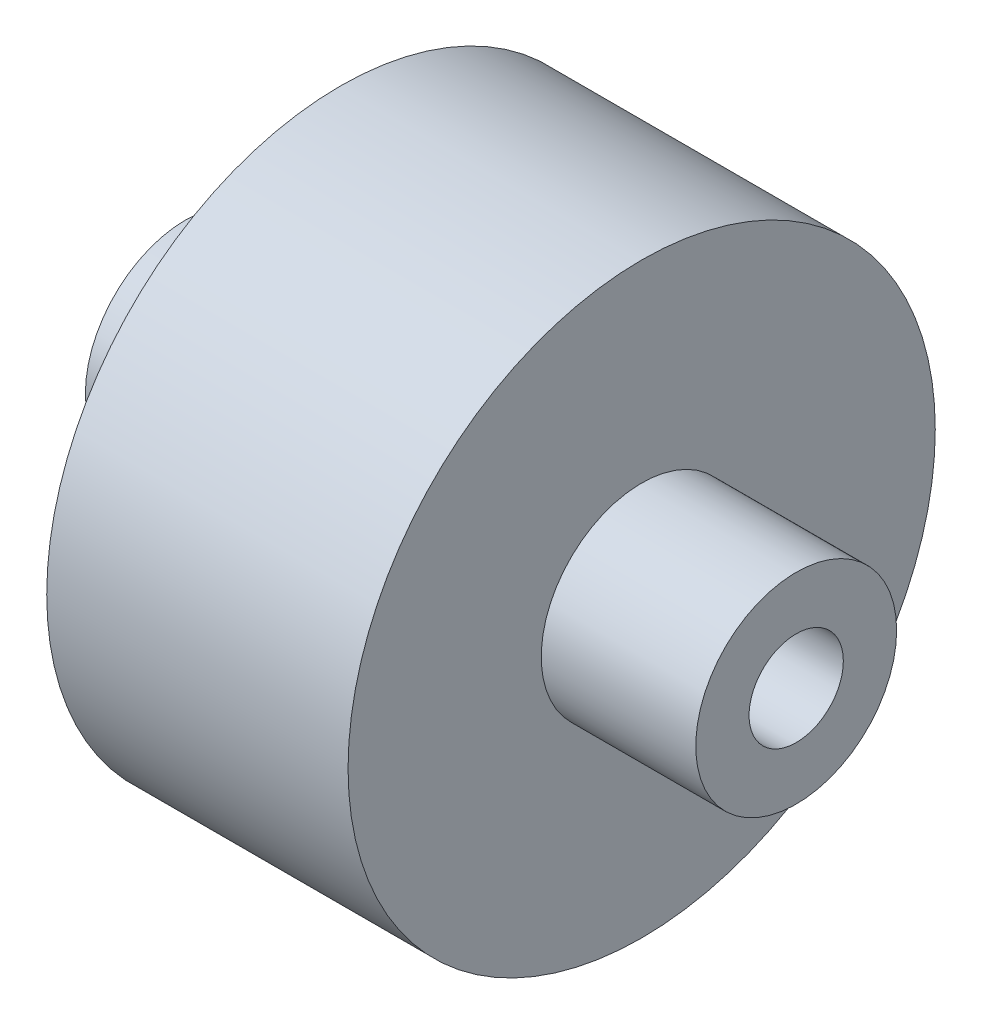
ISO-10303-21;
HEADER;
FILE_DESCRIPTION(('STEP AP214'),'2;1');
FILE_NAME('part.step','',(''),(''),'','','');
FILE_SCHEMA(('AUTOMOTIVE_DESIGN { 1 0 10303 214 1 1 1 1 }'));
ENDSEC;
DATA;
#1=APPLICATION_CONTEXT('core data for automotive mechanical design processes');
#2=APPLICATION_PROTOCOL_DEFINITION('international standard','automotive_design',2000,#1);
#3=PRODUCT_CONTEXT('',#1,'mechanical');
#4=PRODUCT('Part','Part','',(#3));
#5=PRODUCT_RELATED_PRODUCT_CATEGORY('part','',(#4));
#6=PRODUCT_DEFINITION_FORMATION('','',#4);
#7=PRODUCT_DEFINITION_CONTEXT('part definition',#1,'design');
#8=PRODUCT_DEFINITION('design','',#6,#7);
#9=PRODUCT_DEFINITION_SHAPE('','',#8);
#10=(LENGTH_UNIT() NAMED_UNIT(*) SI_UNIT(.MILLI.,.METRE.));
#11=(NAMED_UNIT(*) PLANE_ANGLE_UNIT() SI_UNIT($,.RADIAN.));
#12=(NAMED_UNIT(*) SI_UNIT($,.STERADIAN.) SOLID_ANGLE_UNIT());
#13=UNCERTAINTY_MEASURE_WITH_UNIT(LENGTH_MEASURE(1.E-05),#10,'distance_accuracy_value','');
#14=(GEOMETRIC_REPRESENTATION_CONTEXT(3) GLOBAL_UNCERTAINTY_ASSIGNED_CONTEXT((#13)) GLOBAL_UNIT_ASSIGNED_CONTEXT((#10,
#11,#12)) REPRESENTATION_CONTEXT('',''));
#15=CARTESIAN_POINT('',(0.,0.,0.));
#16=DIRECTION('',(0.,0.,1.));
#17=DIRECTION('',(1.,0.,0.));
#18=AXIS2_PLACEMENT_3D('',#15,#16,#17);
#19=CARTESIAN_POINT('',(19.5,0.,0.));
#20=DIRECTION('',(-1.,0.,0.));
#21=DIRECTION('',(0.,0.,1.));
#22=AXIS2_PLACEMENT_3D('',#19,#20,#21);
#23=CYLINDRICAL_SURFACE('',#22,19.);
#24=CARTESIAN_POINT('',(19.5,0.,0.));
#25=DIRECTION('',(1.,0.,0.));
#26=DIRECTION('',(0.,0.,-1.));
#27=AXIS2_PLACEMENT_3D('',#24,#25,#26);
#28=CIRCLE('',#27,19.);
#29=CARTESIAN_POINT('',(19.5,0.,-19.));
#30=VERTEX_POINT('',#29);
#31=EDGE_CURVE('E37',#30,#30,#28,.T.);
#32=ORIENTED_EDGE('',*,*,#31,.F.);
#33=EDGE_LOOP('',(#32));
#34=FACE_BOUND('',#33,.T.);
#35=CARTESIAN_POINT('',(0.,0.,0.));
#36=DIRECTION('',(1.,0.,0.));
#37=DIRECTION('',(0.,0.,-1.));
#38=AXIS2_PLACEMENT_3D('',#35,#36,#37);
#39=CIRCLE('',#38,19.);
#40=CARTESIAN_POINT('',(0.,0.,-19.));
#41=VERTEX_POINT('',#40);
#42=EDGE_CURVE('E41',#41,#41,#39,.T.);
#43=ORIENTED_EDGE('',*,*,#42,.T.);
#44=EDGE_LOOP('',(#43));
#45=FACE_BOUND('',#44,.T.);
#46=ADVANCED_FACE('F31',(#34,#45),#23,.T.);
#47=CARTESIAN_POINT('',(19.5,0.,0.));
#48=DIRECTION('',(1.,0.,0.));
#49=DIRECTION('',(0.,0.,-1.));
#50=AXIS2_PLACEMENT_3D('',#47,#48,#49);
#51=PLANE('',#50);
#52=CARTESIAN_POINT('',(19.5,0.,0.));
#53=DIRECTION('',(1.,0.,0.));
#54=DIRECTION('',(0.,0.,-1.));
#55=AXIS2_PLACEMENT_3D('',#52,#53,#54);
#56=CIRCLE('',#55,6.5);
#57=CARTESIAN_POINT('',(19.5,0.,-6.5));
#58=VERTEX_POINT('',#57);
#59=EDGE_CURVE('E48',#58,#58,#56,.T.);
#60=ORIENTED_EDGE('',*,*,#59,.F.);
#61=EDGE_LOOP('',(#60));
#62=FACE_BOUND('',#61,.T.);
#63=ORIENTED_EDGE('',*,*,#31,.T.);
#64=EDGE_LOOP('',(#63));
#65=FACE_BOUND('',#64,.T.);
#66=ADVANCED_FACE('F77',(#62,#65),#51,.T.);
#67=CARTESIAN_POINT('',(0.,0.,0.));
#68=DIRECTION('',(1.,0.,0.));
#69=DIRECTION('',(0.,0.,-1.));
#70=AXIS2_PLACEMENT_3D('',#67,#68,#69);
#71=PLANE('',#70);
#72=CARTESIAN_POINT('',(0.,0.,0.));
#73=DIRECTION('',(1.,0.,0.));
#74=DIRECTION('',(0.,0.,-1.));
#75=AXIS2_PLACEMENT_3D('',#72,#73,#74);
#76=CIRCLE('',#75,6.5);
#77=CARTESIAN_POINT('',(0.,0.,-6.5));
#78=VERTEX_POINT('',#77);
#79=EDGE_CURVE('E10',#78,#78,#76,.F.);
#80=ORIENTED_EDGE('',*,*,#79,.F.);
#81=EDGE_LOOP('',(#80));
#82=FACE_BOUND('',#81,.T.);
#83=ORIENTED_EDGE('',*,*,#42,.F.);
#84=EDGE_LOOP('',(#83));
#85=FACE_BOUND('',#84,.T.);
#86=ADVANCED_FACE('F82',(#82,#85),#71,.F.);
#87=CARTESIAN_POINT('',(29.5,0.,0.));
#88=DIRECTION('',(-1.,0.,0.));
#89=DIRECTION('',(0.,0.,1.));
#90=AXIS2_PLACEMENT_3D('',#87,#88,#89);
#91=CYLINDRICAL_SURFACE('',#90,6.5);
#92=CARTESIAN_POINT('',(29.5,0.,0.));
#93=DIRECTION('',(1.,0.,0.));
#94=DIRECTION('',(0.,0.,-1.));
#95=AXIS2_PLACEMENT_3D('',#92,#93,#94);
#96=CIRCLE('',#95,6.5);
#97=CARTESIAN_POINT('',(29.5,0.,-6.5));
#98=VERTEX_POINT('',#97);
#99=EDGE_CURVE('E46',#98,#98,#96,.T.);
#100=ORIENTED_EDGE('',*,*,#99,.F.);
#101=EDGE_LOOP('',(#100));
#102=FACE_BOUND('',#101,.T.);
#103=ORIENTED_EDGE('',*,*,#59,.T.);
#104=EDGE_LOOP('',(#103));
#105=FACE_BOUND('',#104,.T.);
#106=ADVANCED_FACE('F89',(#102,#105),#91,.T.);
#107=CARTESIAN_POINT('',(29.5,0.,0.));
#108=DIRECTION('',(1.,0.,0.));
#109=DIRECTION('',(0.,0.,-1.));
#110=AXIS2_PLACEMENT_3D('',#107,#108,#109);
#111=PLANE('',#110);
#112=CARTESIAN_POINT('',(29.5,0.,0.));
#113=DIRECTION('',(1.,0.,0.));
#114=DIRECTION('',(0.,0.,-1.));
#115=AXIS2_PLACEMENT_3D('',#112,#113,#114);
#116=CIRCLE('',#115,3.05);
#117=CARTESIAN_POINT('',(29.5,0.,-3.05));
#118=VERTEX_POINT('',#117);
#119=EDGE_CURVE('E56',#118,#118,#116,.T.);
#120=ORIENTED_EDGE('',*,*,#119,.F.);
#121=EDGE_LOOP('',(#120));
#122=FACE_BOUND('',#121,.T.);
#123=ORIENTED_EDGE('',*,*,#99,.T.);
#124=EDGE_LOOP('',(#123));
#125=FACE_BOUND('',#124,.T.);
#126=ADVANCED_FACE('F94',(#122,#125),#111,.T.);
#127=CARTESIAN_POINT('',(-10.,0.,0.));
#128=DIRECTION('',(1.,0.,0.));
#129=DIRECTION('',(0.,0.,-1.));
#130=AXIS2_PLACEMENT_3D('',#127,#128,#129);
#131=CYLINDRICAL_SURFACE('',#130,6.5);
#132=CARTESIAN_POINT('',(-10.,0.,0.));
#133=DIRECTION('',(-1.,0.,0.));
#134=DIRECTION('',(0.,0.,1.));
#135=AXIS2_PLACEMENT_3D('',#132,#133,#134);
#136=CIRCLE('',#135,6.5);
#137=CARTESIAN_POINT('',(-10.,0.,6.5));
#138=VERTEX_POINT('',#137);
#139=EDGE_CURVE('E51',#138,#138,#136,.T.);
#140=ORIENTED_EDGE('',*,*,#139,.F.);
#141=EDGE_LOOP('',(#140));
#142=FACE_BOUND('',#141,.T.);
#143=ORIENTED_EDGE('',*,*,#79,.T.);
#144=EDGE_LOOP('',(#143));
#145=FACE_BOUND('',#144,.T.);
#146=ADVANCED_FACE('F74',(#142,#145),#131,.T.);
#147=CARTESIAN_POINT('',(-10.,0.,0.));
#148=DIRECTION('',(-1.,0.,0.));
#149=DIRECTION('',(0.,0.,1.));
#150=AXIS2_PLACEMENT_3D('',#147,#148,#149);
#151=PLANE('',#150);
#152=CARTESIAN_POINT('',(-10.,0.,0.));
#153=DIRECTION('',(1.,0.,0.));
#154=DIRECTION('',(0.,0.,-1.));
#155=AXIS2_PLACEMENT_3D('',#152,#153,#154);
#156=CIRCLE('',#155,3.05);
#157=CARTESIAN_POINT('',(-10.,0.,-3.05));
#158=VERTEX_POINT('',#157);
#159=EDGE_CURVE('E59',#158,#158,#156,.T.);
#160=ORIENTED_EDGE('',*,*,#159,.T.);
#161=EDGE_LOOP('',(#160));
#162=FACE_BOUND('',#161,.T.);
#163=ORIENTED_EDGE('',*,*,#139,.T.);
#164=EDGE_LOOP('',(#163));
#165=FACE_BOUND('',#164,.T.);
#166=ADVANCED_FACE('F63',(#162,#165),#151,.T.);
#167=CARTESIAN_POINT('',(-10.,0.,0.));
#168=DIRECTION('',(1.,0.,0.));
#169=DIRECTION('',(0.,0.,-1.));
#170=AXIS2_PLACEMENT_3D('',#167,#168,#169);
#171=CYLINDRICAL_SURFACE('',#170,3.05);
#172=ORIENTED_EDGE('',*,*,#119,.T.);
#173=EDGE_LOOP('',(#172));
#174=FACE_BOUND('',#173,.T.);
#175=ORIENTED_EDGE('',*,*,#159,.F.);
#176=EDGE_LOOP('',(#175));
#177=FACE_BOUND('',#176,.T.);
#178=ADVANCED_FACE('F66',(#174,#177),#171,.F.);
#179=CLOSED_SHELL('',(#46,#66,#86,#106,#126,#146,#166,#178));
#180=MANIFOLD_SOLID_BREP('B2',#179);
#181=ADVANCED_BREP_SHAPE_REPRESENTATION('',(#18,#180),#14);
#182=SHAPE_DEFINITION_REPRESENTATION(#9,#181);
ENDSEC;
END-ISO-10303-21;
